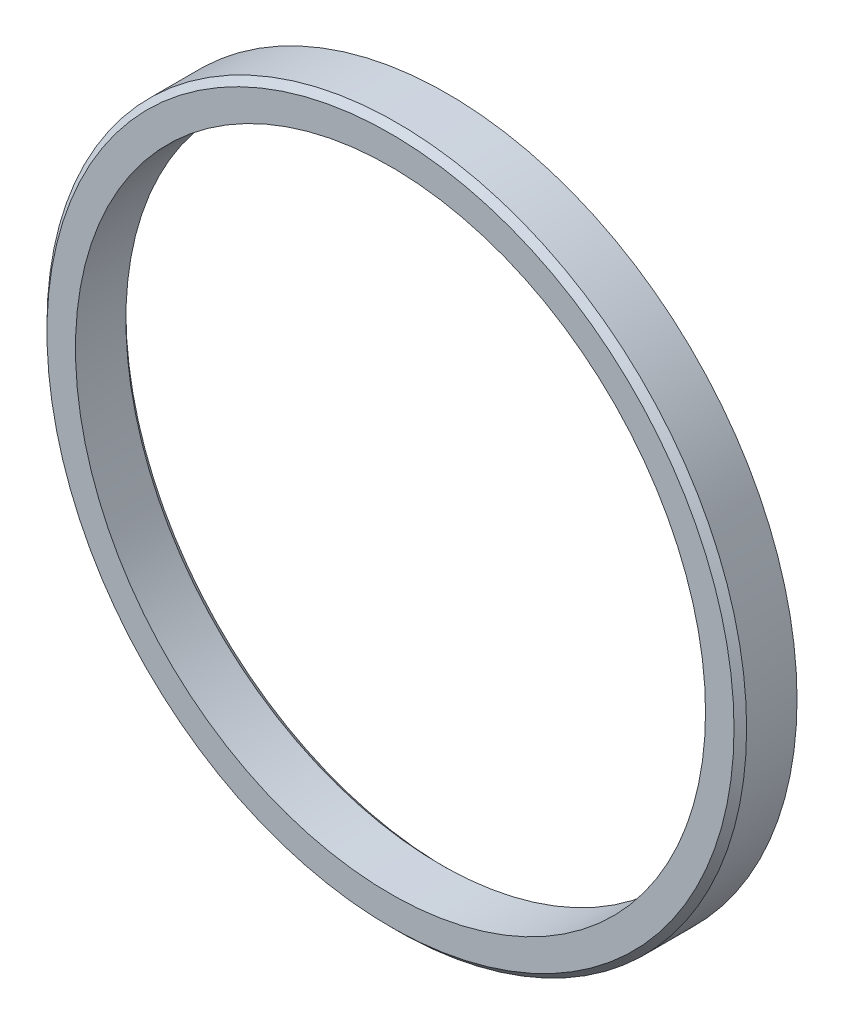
from build123d import *


with BuildPart() as part:
    # Sketch1 → Revolve1 (revolve)
    with BuildSketch(Plane(origin=(0, 0, 0), x_dir=(0, 0, -1), z_dir=(1, 0, 0)), mode=Mode.PRIVATE) as revolve1_sk:
        Polygon((-8, 100), (8, 100), (10, 102), (10, 111.05), (-6, 111.05), (-8, 109.05), align=None)
    revolve(revolve1_sk.sketch.rotate(Axis((0, 0, 66.622749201), (0, 0, -1)), 90), axis=Axis((0, 0, 66.622749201), (0, 0, -1)))


solid = part.part
